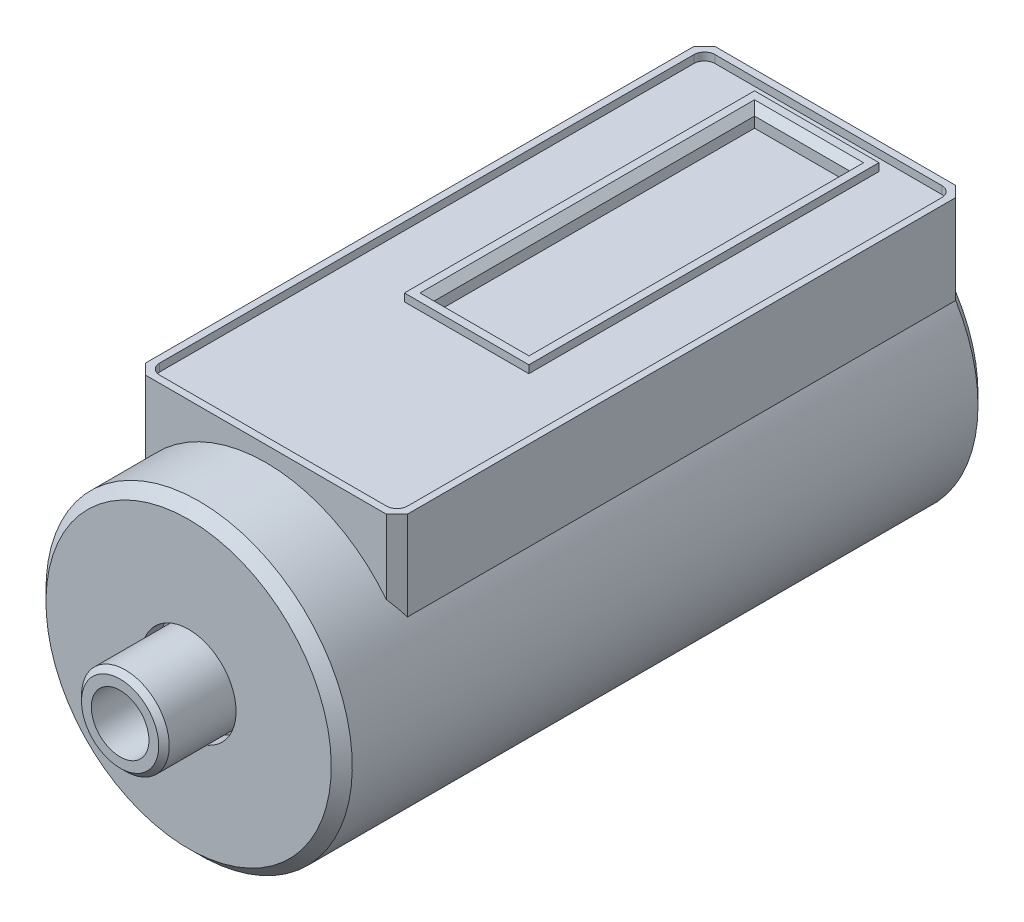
from build123d import *

# Parameters (mm, degrees)
EXTRUDE1_DEPTH     = 12.19
CHAMFER1_SIZE      = 0.76
SKETCH4_W          = 8.99
SKETCH4_H          = 25.3
CUT_EXTRUDE1_DEPTH = 0.56
SKETCH5_W          = 6.86
SKETCH5_H          = 23.16
CUT_EXTRUDE2_DEPTH = 1.27
CHAMFER2_SIZE      = 0.51
HOLE1_D            = 4.1656
HOLE1_DEPTH        = 6.35
HOLE1_TIP          = 1.251472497


with BuildPart() as part:
    # Sketch2 → Revolve1 (revolve)
    with BuildSketch(Plane(origin=(0, 0, 0), x_dir=(0, 0, -1), z_dir=(1, 0, 0))):
        Polygon((161.035, 0), (161.035, 2.79), (161.415, 3.17), (167.255, 3.17), (167.255, 3.43), (165.985, 3.43), (165.985, 10.31), (166.745, 11.07), (212.725, 11.07), (212.725, 0), align=None)
    revolve(axis=Axis((0, 0, -212.725), (0, 0, 1)))

    # Sketch3 → Extrude1 (add)
    with BuildSketch(Plane(origin=(0, 0, 0), x_dir=(1, 0, 0), z_dir=(0, 1, 0))):
        Polygon((-9.46, 212.725), (9.46, 212.725), (9.46, 172.335), (8.7, 171.575), (-8.7, 171.575), (-9.46, 172.335), align=None)
    extrude(amount=EXTRUDE1_DEPTH)

    # Chamfer1
    chamfer1_edges = [part.edges().sort_by_distance(p)[0] for p in [
        (0, -11.07, -212.725),
        (-9.46, 8.969599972, -212.725),
        (9.46, 8.969599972, -212.725),
    ]]
    chamfer(chamfer1_edges, length=CHAMFER1_SIZE)

    # Sketch4 → Cut-Extrude1 (cut)
    with BuildSketch(Plane(origin=(0, 12.19, 0), x_dir=(1, 0, 0), z_dir=(0, 1, 0))):
        with BuildLine():
            Line((-8.19, 212.215), (8.2, 212.215))
            ThreePointArc((8.2, 212.215), (8.737401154, 211.992401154), (8.96, 211.455))
            Line((8.96, 211.455), (8.96, 172.845))
            ThreePointArc((8.96, 172.845), (8.737401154, 172.307598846), (8.2, 172.085))
            Line((8.2, 172.085), (-8.19, 172.085))
            ThreePointArc((-8.19, 172.085), (-8.727401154, 172.307598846), (-8.95, 172.845))
            Line((-8.95, 172.845), (-8.95, 211.455))
            ThreePointArc((-8.95, 211.455), (-8.727401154, 211.992401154), (-8.19, 212.215))
        make_face()
        with Locations((0.005, 198.725)):
            Rectangle(SKETCH4_W, SKETCH4_H, mode=Mode.SUBTRACT)
    extrude(amount=-CUT_EXTRUDE1_DEPTH, mode=Mode.SUBTRACT)

    # Sketch5 → Cut-Extrude2 (cut)
    with BuildSketch(Plane(origin=(0, 12.19, 0), x_dir=(1, 0, 0), z_dir=(0, 1, 0))):
        with Locations((0.01, 198.725)):
            Rectangle(SKETCH5_W, SKETCH5_H)
    extrude(amount=-CUT_EXTRUDE2_DEPTH, mode=Mode.SUBTRACT)

    # Chamfer2
    chamfer2_edges = [part.edges().sort_by_distance(p)[0] for p in [
        (-3.42, 12.19, -198.725),
        (0.01, 12.19, -187.145),
        (3.44, 12.19, -198.725),
        (0.01, 12.19, -210.305),
    ]]
    chamfer(chamfer2_edges, length=CHAMFER2_SIZE)

    # Hole1
    with Locations(Plane.XY.offset(-161.035)):
        with Locations((0, 0)):
            Hole(HOLE1_D / 2, depth=HOLE1_DEPTH)
            with Locations((0, 0, -(HOLE1_DEPTH + HOLE1_TIP / 2))):  # 118° drill point
                Cone(0, HOLE1_D / 2, HOLE1_TIP, mode=Mode.SUBTRACT)


solid = part.part
